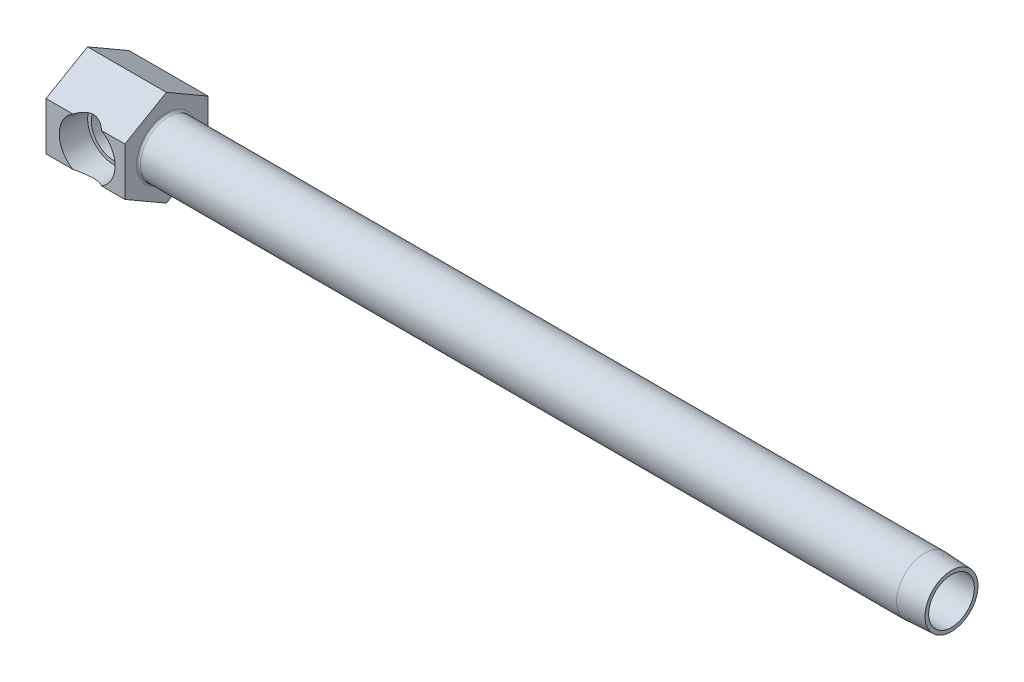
ISO-10303-21;
HEADER;
FILE_DESCRIPTION(('STEP AP214'),'2;1');
FILE_NAME('part.step','',(''),(''),'','','');
FILE_SCHEMA(('AUTOMOTIVE_DESIGN { 1 0 10303 214 1 1 1 1 }'));
ENDSEC;
DATA;
#1=APPLICATION_CONTEXT('core data for automotive mechanical design processes');
#2=APPLICATION_PROTOCOL_DEFINITION('international standard','automotive_design',2000,#1);
#3=PRODUCT_CONTEXT('',#1,'mechanical');
#4=PRODUCT('Part','Part','',(#3));
#5=PRODUCT_RELATED_PRODUCT_CATEGORY('part','',(#4));
#6=PRODUCT_DEFINITION_FORMATION('','',#4);
#7=PRODUCT_DEFINITION_CONTEXT('part definition',#1,'design');
#8=PRODUCT_DEFINITION('design','',#6,#7);
#9=PRODUCT_DEFINITION_SHAPE('','',#8);
#10=(LENGTH_UNIT() NAMED_UNIT(*) SI_UNIT(.MILLI.,.METRE.));
#11=(NAMED_UNIT(*) PLANE_ANGLE_UNIT() SI_UNIT($,.RADIAN.));
#12=(NAMED_UNIT(*) SI_UNIT($,.STERADIAN.) SOLID_ANGLE_UNIT());
#13=UNCERTAINTY_MEASURE_WITH_UNIT(LENGTH_MEASURE(1.E-05),#10,'distance_accuracy_value','');
#14=(GEOMETRIC_REPRESENTATION_CONTEXT(3) GLOBAL_UNCERTAINTY_ASSIGNED_CONTEXT((#13)) GLOBAL_UNIT_ASSIGNED_CONTEXT((#10,
#11,#12)) REPRESENTATION_CONTEXT('',''));
#15=CARTESIAN_POINT('',(0.,0.,0.));
#16=DIRECTION('',(0.,0.,1.));
#17=DIRECTION('',(1.,0.,0.));
#18=AXIS2_PLACEMENT_3D('',#15,#16,#17);
#19=CARTESIAN_POINT('',(63.5,0.,15.875));
#20=DIRECTION('',(-1.,0.,0.));
#21=DIRECTION('',(0.,0.,1.));
#22=AXIS2_PLACEMENT_3D('',#19,#20,#21);
#23=CYLINDRICAL_SURFACE('',#22,10.668);
#24=CARTESIAN_POINT('',(30.9499,0.,15.875));
#25=DIRECTION('',(1.,0.,0.));
#26=DIRECTION('',(0.,1.,0.));
#27=AXIS2_PLACEMENT_3D('',#24,#25,#26);
#28=CIRCLE('',#27,10.668);
#29=CARTESIAN_POINT('',(30.9499,10.668,15.875));
#30=VERTEX_POINT('',#29);
#31=EDGE_CURVE('E191',#30,#30,#28,.T.);
#32=ORIENTED_EDGE('',*,*,#31,.T.);
#33=EDGE_LOOP('',(#32));
#34=FACE_BOUND('',#33,.T.);
#35=CARTESIAN_POINT('',(319.8876,0.,15.875));
#36=DIRECTION('',(1.,0.,0.));
#37=DIRECTION('',(0.,0.,-1.));
#38=AXIS2_PLACEMENT_3D('',#35,#36,#37);
#39=CIRCLE('',#38,10.668);
#40=CARTESIAN_POINT('',(319.8876,0.,5.207));
#41=VERTEX_POINT('',#40);
#42=EDGE_CURVE('E256',#41,#41,#39,.T.);
#43=ORIENTED_EDGE('',*,*,#42,.F.);
#44=EDGE_LOOP('',(#43));
#45=FACE_BOUND('',#44,.T.);
#46=ADVANCED_FACE('F15',(#34,#45),#23,.T.);
#47=CARTESIAN_POINT('',(30.1625,18.3308710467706,15.875));
#48=DIRECTION('',(0.,-0.866025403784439,-0.5));
#49=DIRECTION('',(0.,0.5,-0.866025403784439));
#50=AXIS2_PLACEMENT_3D('',#47,#48,#49);
#51=PLANE('',#50);
#52=CARTESIAN_POINT('',(15.748,-1.05255916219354,49.4480859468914));
#53=DIRECTION('',(0.,-0.866025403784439,-0.5));
#54=DIRECTION('',(0.,-0.5,0.866025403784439));
#55=AXIS2_PLACEMENT_3D('',#52,#53,#54);
#56=ELLIPSE('',#55,23.191034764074,11.5476466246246);
#57=CARTESIAN_POINT('',(21.2070306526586,9.16543552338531,31.75));
#58=VERTEX_POINT('',#57);
#59=CARTESIAN_POINT('',(10.2889693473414,9.16543552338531,31.75));
#60=VERTEX_POINT('',#59);
#61=EDGE_CURVE('E135',#58,#60,#56,.F.);
#62=ORIENTED_EDGE('',*,*,#61,.F.);
#63=DIRECTION('',(-1.,0.,0.));
#64=VECTOR('',#63,1.);
#65=CARTESIAN_POINT('',(30.1625,9.16543552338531,31.75));
#66=LINE('',#65,#64);
#67=CARTESIAN_POINT('',(30.1625,9.16543552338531,31.75));
#68=VERTEX_POINT('',#67);
#69=EDGE_CURVE('E179',#68,#58,#66,.T.);
#70=ORIENTED_EDGE('',*,*,#69,.F.);
#71=DIRECTION('',(0.,-0.5,0.866025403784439));
#72=VECTOR('',#71,1.);
#73=CARTESIAN_POINT('',(30.1625,18.3308710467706,15.875));
#74=LINE('',#73,#72);
#75=CARTESIAN_POINT('',(30.1625,18.3308710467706,15.875));
#76=VERTEX_POINT('',#75);
#77=EDGE_CURVE('E163',#76,#68,#74,.T.);
#78=ORIENTED_EDGE('',*,*,#77,.F.);
#79=DIRECTION('',(-1.,0.,0.));
#80=VECTOR('',#79,1.);
#81=CARTESIAN_POINT('',(30.1625,18.3308710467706,15.875));
#82=LINE('',#81,#80);
#83=CARTESIAN_POINT('',(0.,18.3308710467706,15.875));
#84=VERTEX_POINT('',#83);
#85=EDGE_CURVE('E182',#76,#84,#82,.T.);
#86=ORIENTED_EDGE('',*,*,#85,.T.);
#87=DIRECTION('',(0.,-0.5,0.866025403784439));
#88=VECTOR('',#87,1.);
#89=CARTESIAN_POINT('',(0.,18.3308710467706,15.875));
#90=LINE('',#89,#88);
#91=CARTESIAN_POINT('',(0.,9.16543552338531,31.75));
#92=VERTEX_POINT('',#91);
#93=EDGE_CURVE('E144',#84,#92,#90,.T.);
#94=ORIENTED_EDGE('',*,*,#93,.T.);
#95=EDGE_CURVE('E178',#60,#92,#66,.T.);
#96=ORIENTED_EDGE('',*,*,#95,.F.);
#97=EDGE_LOOP('',(#62,#70,#78,#86,#94,#96));
#98=FACE_BOUND('',#97,.T.);
#99=ADVANCED_FACE('F210',(#98),#51,.F.);
#100=CARTESIAN_POINT('',(30.1625,9.16543552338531,31.75));
#101=DIRECTION('',(0.,0.,-1.));
#102=DIRECTION('',(-1.,0.,0.));
#103=AXIS2_PLACEMENT_3D('',#100,#101,#102);
#104=PLANE('',#103);
#105=CARTESIAN_POINT('',(15.748,0.,31.75));
#106=DIRECTION('',(0.,0.,-1.));
#107=DIRECTION('',(-1.,0.,0.));
#108=AXIS2_PLACEMENT_3D('',#105,#106,#107);
#109=CIRCLE('',#108,10.668);
#110=CARTESIAN_POINT('',(21.2070306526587,-9.1654355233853,31.75));
#111=VERTEX_POINT('',#110);
#112=EDGE_CURVE('E133',#58,#111,#109,.T.);
#113=ORIENTED_EDGE('',*,*,#112,.T.);
#114=DIRECTION('',(-1.,0.,0.));
#115=VECTOR('',#114,1.);
#116=CARTESIAN_POINT('',(30.1625,-9.1654355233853,31.75));
#117=LINE('',#116,#115);
#118=CARTESIAN_POINT('',(30.1625,-9.1654355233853,31.75));
#119=VERTEX_POINT('',#118);
#120=EDGE_CURVE('E175',#119,#111,#117,.T.);
#121=ORIENTED_EDGE('',*,*,#120,.F.);
#122=DIRECTION('',(0.,-1.,0.));
#123=VECTOR('',#122,1.);
#124=CARTESIAN_POINT('',(30.1625,9.16543552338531,31.75));
#125=LINE('',#124,#123);
#126=EDGE_CURVE('E165',#68,#119,#125,.T.);
#127=ORIENTED_EDGE('',*,*,#126,.F.);
#128=ORIENTED_EDGE('',*,*,#69,.T.);
#129=EDGE_LOOP('',(#113,#121,#127,#128));
#130=FACE_BOUND('',#129,.T.);
#131=ADVANCED_FACE('F206',(#130),#104,.F.);
#132=CARTESIAN_POINT('',(10.2889693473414,-9.1654355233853,31.75));
#133=VERTEX_POINT('',#132);
#134=EDGE_CURVE('E40',#133,#60,#109,.T.);
#135=ORIENTED_EDGE('',*,*,#134,.T.);
#136=ORIENTED_EDGE('',*,*,#95,.T.);
#137=DIRECTION('',(0.,-1.,0.));
#138=VECTOR('',#137,1.);
#139=CARTESIAN_POINT('',(0.,9.16543552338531,31.75));
#140=LINE('',#139,#138);
#141=CARTESIAN_POINT('',(0.,-9.1654355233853,31.75));
#142=VERTEX_POINT('',#141);
#143=EDGE_CURVE('E148',#92,#142,#140,.T.);
#144=ORIENTED_EDGE('',*,*,#143,.T.);
#145=EDGE_CURVE('E174',#133,#142,#117,.T.);
#146=ORIENTED_EDGE('',*,*,#145,.F.);
#147=EDGE_LOOP('',(#135,#136,#144,#146));
#148=FACE_BOUND('',#147,.T.);
#149=ADVANCED_FACE('F213',(#148),#104,.F.);
#150=CARTESIAN_POINT('',(30.1625,-9.1654355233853,31.75));
#151=DIRECTION('',(0.,0.866025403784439,-0.5));
#152=DIRECTION('',(0.,0.5,0.866025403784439));
#153=AXIS2_PLACEMENT_3D('',#150,#151,#152);
#154=PLANE('',#153);
#155=CARTESIAN_POINT('',(15.748,1.05255916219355,49.4480859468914));
#156=DIRECTION('',(0.,0.866025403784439,-0.5));
#157=DIRECTION('',(0.,0.5,0.866025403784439));
#158=AXIS2_PLACEMENT_3D('',#155,#156,#157);
#159=ELLIPSE('',#158,23.191034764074,11.5476466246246);
#160=EDGE_CURVE('E26',#133,#111,#159,.F.);
#161=ORIENTED_EDGE('',*,*,#160,.F.);
#162=ORIENTED_EDGE('',*,*,#145,.T.);
#163=DIRECTION('',(0.,-0.5,-0.866025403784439));
#164=VECTOR('',#163,1.);
#165=CARTESIAN_POINT('',(0.,-9.1654355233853,31.75));
#166=LINE('',#165,#164);
#167=CARTESIAN_POINT('',(0.,-18.3308710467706,15.875));
#168=VERTEX_POINT('',#167);
#169=EDGE_CURVE('E152',#142,#168,#166,.T.);
#170=ORIENTED_EDGE('',*,*,#169,.T.);
#171=DIRECTION('',(-1.,0.,0.));
#172=VECTOR('',#171,1.);
#173=CARTESIAN_POINT('',(30.1625,-18.3308710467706,15.875));
#174=LINE('',#173,#172);
#175=CARTESIAN_POINT('',(30.1625,-18.3308710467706,15.875));
#176=VERTEX_POINT('',#175);
#177=EDGE_CURVE('E169',#176,#168,#174,.T.);
#178=ORIENTED_EDGE('',*,*,#177,.F.);
#179=DIRECTION('',(0.,-0.5,-0.866025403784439));
#180=VECTOR('',#179,1.);
#181=CARTESIAN_POINT('',(30.1625,-9.1654355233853,31.75));
#182=LINE('',#181,#180);
#183=EDGE_CURVE('E167',#119,#176,#182,.T.);
#184=ORIENTED_EDGE('',*,*,#183,.F.);
#185=ORIENTED_EDGE('',*,*,#120,.T.);
#186=EDGE_LOOP('',(#161,#162,#170,#178,#184,#185));
#187=FACE_BOUND('',#186,.T.);
#188=ADVANCED_FACE('F202',(#187),#154,.F.);
#189=CARTESIAN_POINT('',(30.1625,-18.3308710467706,15.875));
#190=DIRECTION('',(0.,0.866025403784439,0.5));
#191=DIRECTION('',(0.,-0.5,0.866025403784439));
#192=AXIS2_PLACEMENT_3D('',#189,#190,#191);
#193=PLANE('',#192);
#194=DIRECTION('',(0.,0.5,-0.866025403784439));
#195=VECTOR('',#194,1.);
#196=CARTESIAN_POINT('',(0.,-18.3308710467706,15.875));
#197=LINE('',#196,#195);
#198=CARTESIAN_POINT('',(0.,-9.16543552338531,0.));
#199=VERTEX_POINT('',#198);
#200=EDGE_CURVE('E137',#168,#199,#197,.T.);
#201=ORIENTED_EDGE('',*,*,#200,.T.);
#202=DIRECTION('',(-1.,0.,0.));
#203=VECTOR('',#202,1.);
#204=CARTESIAN_POINT('',(30.1625,-9.16543552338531,0.));
#205=LINE('',#204,#203);
#206=CARTESIAN_POINT('',(30.1625,-9.16543552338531,0.));
#207=VERTEX_POINT('',#206);
#208=EDGE_CURVE('E188',#207,#199,#205,.T.);
#209=ORIENTED_EDGE('',*,*,#208,.F.);
#210=DIRECTION('',(0.,0.5,-0.866025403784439));
#211=VECTOR('',#210,1.);
#212=CARTESIAN_POINT('',(30.1625,-18.3308710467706,15.875));
#213=LINE('',#212,#211);
#214=EDGE_CURVE('E155',#176,#207,#213,.T.);
#215=ORIENTED_EDGE('',*,*,#214,.F.);
#216=ORIENTED_EDGE('',*,*,#177,.T.);
#217=EDGE_LOOP('',(#201,#209,#215,#216));
#218=FACE_BOUND('',#217,.T.);
#219=ADVANCED_FACE('F220',(#218),#193,.F.);
#220=CARTESIAN_POINT('',(30.1625,-9.16543552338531,0.));
#221=DIRECTION('',(0.,0.,1.));
#222=DIRECTION('',(0.,-1.,0.));
#223=AXIS2_PLACEMENT_3D('',#220,#221,#222);
#224=PLANE('',#223);
#225=DIRECTION('',(0.,1.,0.));
#226=VECTOR('',#225,1.);
#227=CARTESIAN_POINT('',(0.,-9.16543552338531,0.));
#228=LINE('',#227,#226);
#229=CARTESIAN_POINT('',(0.,9.16543552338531,0.));
#230=VERTEX_POINT('',#229);
#231=EDGE_CURVE('E138',#199,#230,#228,.T.);
#232=ORIENTED_EDGE('',*,*,#231,.T.);
#233=DIRECTION('',(-1.,0.,0.));
#234=VECTOR('',#233,1.);
#235=CARTESIAN_POINT('',(30.1625,9.16543552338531,0.));
#236=LINE('',#235,#234);
#237=CARTESIAN_POINT('',(30.1625,9.16543552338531,0.));
#238=VERTEX_POINT('',#237);
#239=EDGE_CURVE('E185',#238,#230,#236,.T.);
#240=ORIENTED_EDGE('',*,*,#239,.F.);
#241=DIRECTION('',(0.,1.,0.));
#242=VECTOR('',#241,1.);
#243=CARTESIAN_POINT('',(30.1625,-9.16543552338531,0.));
#244=LINE('',#243,#242);
#245=EDGE_CURVE('E159',#207,#238,#244,.T.);
#246=ORIENTED_EDGE('',*,*,#245,.F.);
#247=ORIENTED_EDGE('',*,*,#208,.T.);
#248=EDGE_LOOP('',(#232,#240,#246,#247));
#249=FACE_BOUND('',#248,.T.);
#250=ADVANCED_FACE('F227',(#249),#224,.F.);
#251=CARTESIAN_POINT('',(30.1625,9.16543552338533,0.));
#252=DIRECTION('',(0.,-0.86602540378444,0.5));
#253=DIRECTION('',(0.,-0.5,-0.86602540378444));
#254=AXIS2_PLACEMENT_3D('',#251,#252,#253);
#255=PLANE('',#254);
#256=DIRECTION('',(0.,0.5,0.86602540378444));
#257=VECTOR('',#256,1.);
#258=CARTESIAN_POINT('',(0.,9.16543552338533,0.));
#259=LINE('',#258,#257);
#260=EDGE_CURVE('E141',#230,#84,#259,.T.);
#261=ORIENTED_EDGE('',*,*,#260,.T.);
#262=ORIENTED_EDGE('',*,*,#85,.F.);
#263=DIRECTION('',(0.,0.5,0.86602540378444));
#264=VECTOR('',#263,1.);
#265=CARTESIAN_POINT('',(30.1625,9.16543552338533,0.));
#266=LINE('',#265,#264);
#267=EDGE_CURVE('E161',#238,#76,#266,.T.);
#268=ORIENTED_EDGE('',*,*,#267,.F.);
#269=ORIENTED_EDGE('',*,*,#239,.T.);
#270=EDGE_LOOP('',(#261,#262,#268,#269));
#271=FACE_BOUND('',#270,.T.);
#272=ADVANCED_FACE('F233',(#271),#255,.F.);
#273=CARTESIAN_POINT('',(30.1625,-9.16543552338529,0.));
#274=DIRECTION('',(1.,0.,0.));
#275=DIRECTION('',(0.,1.,0.));
#276=AXIS2_PLACEMENT_3D('',#273,#274,#275);
#277=PLANE('',#276);
#278=CARTESIAN_POINT('',(30.1625,0.,15.875));
#279=DIRECTION('',(1.,0.,0.));
#280=DIRECTION('',(0.,1.,0.));
#281=AXIS2_PLACEMENT_3D('',#278,#279,#280);
#282=CIRCLE('',#281,11.4554);
#283=CARTESIAN_POINT('',(30.1625,11.4554,15.875));
#284=VERTEX_POINT('',#283);
#285=EDGE_CURVE('E194',#284,#284,#282,.F.);
#286=ORIENTED_EDGE('',*,*,#285,.T.);
#287=EDGE_LOOP('',(#286));
#288=FACE_BOUND('',#287,.T.);
#289=ORIENTED_EDGE('',*,*,#214,.T.);
#290=ORIENTED_EDGE('',*,*,#245,.T.);
#291=ORIENTED_EDGE('',*,*,#267,.T.);
#292=ORIENTED_EDGE('',*,*,#77,.T.);
#293=ORIENTED_EDGE('',*,*,#126,.T.);
#294=ORIENTED_EDGE('',*,*,#183,.T.);
#295=EDGE_LOOP('',(#289,#290,#291,#292,#293,#294));
#296=FACE_BOUND('',#295,.T.);
#297=ADVANCED_FACE('F230',(#288,#296),#277,.T.);
#298=CARTESIAN_POINT('',(0.,-9.16543552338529,0.));
#299=DIRECTION('',(1.,0.,0.));
#300=DIRECTION('',(0.,1.,0.));
#301=AXIS2_PLACEMENT_3D('',#298,#299,#300);
#302=PLANE('',#301);
#303=ORIENTED_EDGE('',*,*,#200,.F.);
#304=ORIENTED_EDGE('',*,*,#169,.F.);
#305=ORIENTED_EDGE('',*,*,#143,.F.);
#306=ORIENTED_EDGE('',*,*,#93,.F.);
#307=ORIENTED_EDGE('',*,*,#260,.F.);
#308=ORIENTED_EDGE('',*,*,#231,.F.);
#309=EDGE_LOOP('',(#303,#304,#305,#306,#307,#308));
#310=FACE_BOUND('',#309,.T.);
#311=ADVANCED_FACE('F222',(#310),#302,.F.);
#312=CARTESIAN_POINT('',(30.9499,0.,15.875));
#313=DIRECTION('',(1.,0.,0.));
#314=DIRECTION('',(0.,1.,0.));
#315=AXIS2_PLACEMENT_3D('',#312,#313,#314);
#316=TOROIDAL_SURFACE('',#315,11.4554,0.7874);
#317=ORIENTED_EDGE('',*,*,#285,.F.);
#318=EDGE_LOOP('',(#317));
#319=FACE_BOUND('',#318,.T.);
#320=ORIENTED_EDGE('',*,*,#31,.F.);
#321=EDGE_LOOP('',(#320));
#322=FACE_BOUND('',#321,.T.);
#323=ADVANCED_FACE('F331',(#319,#322),#316,.F.);
#324=CARTESIAN_POINT('',(15.748,0.,31.75));
#325=DIRECTION('',(0.,0.,1.));
#326=DIRECTION('',(1.,0.,0.));
#327=AXIS2_PLACEMENT_3D('',#324,#325,#326);
#328=CONICAL_SURFACE('',#327,10.668,0.0523598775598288);
#329=CARTESIAN_POINT('',(23.3158678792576,-6.73011387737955,21.4374));
#330=CARTESIAN_POINT('',(23.4600282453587,-6.58213571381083,21.6163914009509));
#331=CARTESIAN_POINT('',(23.6023884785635,-6.42627781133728,21.7904706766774));
#332=CARTESIAN_POINT('',(23.8817354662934,-6.09837401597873,22.1280133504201));
#333=CARTESIAN_POINT('',(24.0187135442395,-5.92630339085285,22.2914598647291));
#334=CARTESIAN_POINT('',(24.2862441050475,-5.56440643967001,22.6077795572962));
#335=CARTESIAN_POINT('',(24.4167288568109,-5.37443622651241,22.7605461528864));
#336=CARTESIAN_POINT('',(24.6677167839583,-4.97815123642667,23.0522714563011));
#337=CARTESIAN_POINT('',(24.7882261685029,-4.77184678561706,23.1912387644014));
#338=CARTESIAN_POINT('',(24.9921660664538,-4.38969848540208,23.4250980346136));
#339=CARTESIAN_POINT('',(25.0779672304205,-4.21696245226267,23.5230096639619));
#340=CARTESIAN_POINT('',(25.2408840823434,-3.86199712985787,23.7082473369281));
#341=CARTESIAN_POINT('',(25.3180018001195,-3.67977007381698,23.7955758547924));
#342=CARTESIAN_POINT('',(25.4621670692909,-3.30686520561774,23.9583559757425));
#343=CARTESIAN_POINT('',(25.529240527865,-3.11621083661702,24.0338381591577));
#344=CARTESIAN_POINT('',(25.6523303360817,-2.72696762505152,24.1720474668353));
#345=CARTESIAN_POINT('',(25.7083523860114,-2.52838293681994,24.2347811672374));
#346=CARTESIAN_POINT('',(25.808749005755,-2.12236093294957,24.3470188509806));
#347=CARTESIAN_POINT('',(25.8530023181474,-1.91485526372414,24.3963851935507));
#348=CARTESIAN_POINT('',(25.9281094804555,-1.49442789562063,24.4800766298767));
#349=CARTESIAN_POINT('',(25.9589631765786,-1.2815061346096,24.5144015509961));
#350=CARTESIAN_POINT('',(26.0065047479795,-0.852126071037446,24.5672608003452));
#351=CARTESIAN_POINT('',(26.023192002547,-0.635667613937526,24.5857944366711));
#352=CARTESIAN_POINT('',(26.0419565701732,-0.201352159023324,24.6066338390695));
#353=CARTESIAN_POINT('',(26.0440358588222,0.0165046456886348,24.6089417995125));
#354=CARTESIAN_POINT('',(26.0342583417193,0.421689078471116,24.5980844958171));
#355=CARTESIAN_POINT('',(26.0242658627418,0.609123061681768,24.5869892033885));
#356=CARTESIAN_POINT('',(25.9935596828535,0.982016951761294,24.552869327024));
#357=CARTESIAN_POINT('',(25.9728460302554,1.16747686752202,24.5298447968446));
#358=CARTESIAN_POINT('',(25.9211099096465,1.53498981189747,24.4722733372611));
#359=CARTESIAN_POINT('',(25.8900948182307,1.71704518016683,24.437734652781));
#360=CARTESIAN_POINT('',(25.8183100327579,2.07675633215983,24.3576745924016));
#361=CARTESIAN_POINT('',(25.7775399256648,2.25441192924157,24.3121527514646));
#362=CARTESIAN_POINT('',(25.6868155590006,2.6047674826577,24.2106610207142));
#363=CARTESIAN_POINT('',(25.6368406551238,2.77745527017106,24.1546676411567));
#364=CARTESIAN_POINT('',(25.5285266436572,3.11671661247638,24.0330221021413));
#365=CARTESIAN_POINT('',(25.4701845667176,3.28328797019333,23.9673665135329));
#366=CARTESIAN_POINT('',(25.2834921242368,3.77365322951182,23.7566792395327));
#367=CARTESIAN_POINT('',(25.1436492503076,4.08744436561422,23.5981203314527));
#368=CARTESIAN_POINT('',(24.8735653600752,4.61896069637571,23.289353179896));
#369=CARTESIAN_POINT('',(24.7480029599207,4.84261456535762,23.1450088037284));
#370=CARTESIAN_POINT('',(24.4850001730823,5.27158893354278,22.8402219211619));
#371=CARTESIAN_POINT('',(24.34754826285,5.47689124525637,22.6797637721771));
#372=CARTESIAN_POINT('',(24.0644488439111,5.86754844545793,22.3458754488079));
#373=CARTESIAN_POINT('',(23.918859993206,6.05302358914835,22.1725357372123));
#374=CARTESIAN_POINT('',(23.6957580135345,6.31733501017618,21.90341371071));
#375=CARTESIAN_POINT('',(23.6206767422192,6.40304815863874,21.8122772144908));
#376=CARTESIAN_POINT('',(23.4691939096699,6.56995442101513,21.6270388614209));
#377=CARTESIAN_POINT('',(23.3927925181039,6.65114811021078,21.5329373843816));
#378=CARTESIAN_POINT('',(23.3158678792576,6.73011387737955,21.4374));
#379=B_SPLINE_CURVE_WITH_KNOTS('',3,(#329,#330,#331,#332,#333,#334,#335,#336,#337,#338,#339,
#340,#341,#342,#343,#344,#345,#346,#347,#348,#349,#350,#351,#352,#353,#354,#355,#356,#357,#358,
#359,#360,#361,#362,#363,#364,#365,#366,#367,#368,#369,#370,#371,#372,#373,#374,#375,#376,#377,
#378),.UNSPECIFIED.,.F.,.F.,(4,2,2,2,2,2,2,2,2,2,2,2,2,2,2,2,2,2,2,2,2,2,2,2,4),(0.,
0.820023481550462,1.64131879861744,2.46989520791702,3.29795193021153,3.94627694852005,
4.59445010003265,5.24092150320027,5.8870585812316,6.53961554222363,7.19217999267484,
7.84477303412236,8.49727781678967,9.06067705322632,9.6240737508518,10.187067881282,
10.7500858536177,11.3143822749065,11.8788794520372,13.0099648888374,13.8917191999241,
14.7743379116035,15.65125682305,16.0888974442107,16.5264822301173),.UNSPECIFIED.);
#380=CARTESIAN_POINT('',(23.3160289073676,-6.72994857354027,21.4376));
#381=VERTEX_POINT('',#380);
#382=CARTESIAN_POINT('',(23.3160289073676,6.72994857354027,21.4376));
#383=VERTEX_POINT('',#382);
#384=EDGE_CURVE('E119',#381,#383,#379,.T.);
#385=ORIENTED_EDGE('',*,*,#384,.F.);
#386=CARTESIAN_POINT('',(15.748,0.,21.4376));
#387=DIRECTION('',(0.,0.,-1.));
#388=DIRECTION('',(-1.,0.,0.));
#389=AXIS2_PLACEMENT_3D('',#386,#387,#388);
#390=CIRCLE('',#389,10.1275500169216);
#391=EDGE_CURVE('E121',#381,#383,#390,.T.);
#392=ORIENTED_EDGE('',*,*,#391,.T.);
#393=EDGE_LOOP('',(#385,#392));
#394=FACE_BOUND('',#393,.T.);
#395=ORIENTED_EDGE('',*,*,#61,.T.);
#396=ORIENTED_EDGE('',*,*,#134,.F.);
#397=ORIENTED_EDGE('',*,*,#160,.T.);
#398=ORIENTED_EDGE('',*,*,#112,.F.);
#399=EDGE_LOOP('',(#395,#396,#397,#398));
#400=FACE_BOUND('',#399,.T.);
#401=ADVANCED_FACE('F196',(#394,#400),#328,.F.);
#402=CARTESIAN_POINT('',(25.8755500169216,0.,21.4376));
#403=DIRECTION('',(0.,0.,1.));
#404=DIRECTION('',(1.,0.,0.));
#405=AXIS2_PLACEMENT_3D('',#402,#403,#404);
#406=PLANE('',#405);
#407=DIRECTION('',(1.,0.,0.));
#408=VECTOR('',#407,1.);
#409=CARTESIAN_POINT('',(86.8155901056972,-6.72994857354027,21.4376));
#410=LINE('',#409,#408);
#411=CARTESIAN_POINT('',(21.3205618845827,-6.72994857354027,21.4376));
#412=VERTEX_POINT('',#411);
#413=EDGE_CURVE('E123',#412,#381,#410,.T.);
#414=ORIENTED_EDGE('',*,*,#413,.F.);
#415=CARTESIAN_POINT('',(15.748,0.,21.4376));
#416=DIRECTION('',(0.,0.,-1.));
#417=DIRECTION('',(-1.,0.,0.));
#418=AXIS2_PLACEMENT_3D('',#415,#416,#417);
#419=CIRCLE('',#418,8.7376);
#420=CARTESIAN_POINT('',(21.3205618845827,6.72994857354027,21.4376));
#421=VERTEX_POINT('',#420);
#422=EDGE_CURVE('E114',#412,#421,#419,.T.);
#423=ORIENTED_EDGE('',*,*,#422,.T.);
#424=DIRECTION('',(1.,0.,0.));
#425=VECTOR('',#424,1.);
#426=CARTESIAN_POINT('',(86.8155901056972,6.72994857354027,21.4376));
#427=LINE('',#426,#425);
#428=EDGE_CURVE('E115',#383,#421,#427,.F.);
#429=ORIENTED_EDGE('',*,*,#428,.F.);
#430=ORIENTED_EDGE('',*,*,#391,.F.);
#431=EDGE_LOOP('',(#414,#423,#429,#430));
#432=FACE_BOUND('',#431,.T.);
#433=ADVANCED_FACE('F316',(#432),#406,.T.);
#434=CARTESIAN_POINT('',(15.748,0.,43.0975954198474));
#435=DIRECTION('',(0.,0.,-1.));
#436=DIRECTION('',(-1.,0.,0.));
#437=AXIS2_PLACEMENT_3D('',#434,#435,#436);
#438=CYLINDRICAL_SURFACE('',#437,8.7376);
#439=CARTESIAN_POINT('',(24.4856,0.,7.14375000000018));
#440=CARTESIAN_POINT('',(24.4855979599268,-0.194584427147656,7.14375204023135));
#441=CARTESIAN_POINT('',(24.4790855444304,-0.389211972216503,7.15026918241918));
#442=CARTESIAN_POINT('',(24.4531687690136,-0.776828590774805,7.17620489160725));
#443=CARTESIAN_POINT('',(24.4337566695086,-0.969816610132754,7.19563120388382));
#444=CARTESIAN_POINT('',(24.3824080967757,-1.35279132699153,7.24701779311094));
#445=CARTESIAN_POINT('',(24.3504484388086,-1.54277178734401,7.27900127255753));
#446=CARTESIAN_POINT('',(24.2746397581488,-1.91800162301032,7.3548673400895));
#447=CARTESIAN_POINT('',(24.230784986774,-2.10324866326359,7.39875568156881));
#448=CARTESIAN_POINT('',(24.1323992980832,-2.46629304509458,7.49721818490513));
#449=CARTESIAN_POINT('',(24.0779544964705,-2.64413729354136,7.55170615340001));
#450=CARTESIAN_POINT('',(23.9590478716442,-2.99304779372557,7.6707093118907));
#451=CARTESIAN_POINT('',(23.8945822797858,-3.16411146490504,7.73522827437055));
#452=CARTESIAN_POINT('',(23.7566100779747,-3.49864884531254,7.87331790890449));
#453=CARTESIAN_POINT('',(23.6831076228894,-3.66212599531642,7.94688442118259));
#454=CARTESIAN_POINT('',(23.5279457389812,-3.98115293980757,8.10218588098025));
#455=CARTESIAN_POINT('',(23.4462844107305,-4.13670087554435,8.18392273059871));
#456=CARTESIAN_POINT('',(23.2407563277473,-4.50158308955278,8.38964777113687));
#457=CARTESIAN_POINT('',(23.1132942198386,-4.7068770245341,8.51723745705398));
#458=CARTESIAN_POINT('',(22.84617651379,-5.10080513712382,8.7846388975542));
#459=CARTESIAN_POINT('',(22.7065197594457,-5.28943773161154,8.92445181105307));
#460=CARTESIAN_POINT('',(22.4166157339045,-5.65057111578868,9.21470277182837));
#461=CARTESIAN_POINT('',(22.2663444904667,-5.82303320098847,9.36516487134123));
#462=CARTESIAN_POINT('',(21.9571971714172,-6.15161912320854,9.67473646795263));
#463=CARTESIAN_POINT('',(21.7983210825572,-6.30774293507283,9.83384597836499));
#464=CARTESIAN_POINT('',(21.410466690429,-6.66146937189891,10.2223222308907));
#465=CARTESIAN_POINT('',(21.1781519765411,-6.85174414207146,10.4550504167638));
#466=CARTESIAN_POINT('',(20.7027527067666,-7.20301910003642,10.9314300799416));
#467=CARTESIAN_POINT('',(20.4596630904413,-7.36400534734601,11.1750866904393));
#468=CARTESIAN_POINT('',(19.9655914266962,-7.65767994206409,11.6705392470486));
#469=CARTESIAN_POINT('',(19.7146188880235,-7.79040098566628,11.922325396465));
#470=CARTESIAN_POINT('',(19.2066974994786,-8.0288054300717,12.432296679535));
#471=CARTESIAN_POINT('',(18.9497514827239,-8.13450137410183,12.6904787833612));
#472=CARTESIAN_POINT('',(18.535849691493,-8.28254836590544,13.1070621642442));
#473=CARTESIAN_POINT('',(18.3802144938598,-8.3332845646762,13.2638590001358));
#474=CARTESIAN_POINT('',(18.0678223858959,-8.42559206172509,13.5791092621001));
#475=CARTESIAN_POINT('',(17.9110652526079,-8.46716148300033,13.7375630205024));
#476=CARTESIAN_POINT('',(17.6309955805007,-8.53322740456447,14.0215802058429));
#477=CARTESIAN_POINT('',(17.5077848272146,-8.5594718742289,14.1468425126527));
#478=CARTESIAN_POINT('',(17.2618022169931,-8.60637337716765,14.3980579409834));
#479=CARTESIAN_POINT('',(17.1390302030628,-8.62704779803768,14.5240076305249));
#480=CARTESIAN_POINT('',(16.9357825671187,-8.65687758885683,14.7346643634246));
#481=CARTESIAN_POINT('',(16.8550481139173,-8.66756378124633,14.8189101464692));
#482=CARTESIAN_POINT('',(16.6937016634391,-8.68665280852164,14.9894220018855));
#483=CARTESIAN_POINT('',(16.6130990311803,-8.6950316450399,15.0756998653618));
#484=CARTESIAN_POINT('',(16.4936864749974,-8.70581636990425,15.2075729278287));
#485=CARTESIAN_POINT('',(16.453897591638,-8.70912835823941,15.2522143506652));
#486=CARTESIAN_POINT('',(16.3753514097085,-8.71513811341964,15.3428639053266));
#487=CARTESIAN_POINT('',(16.336600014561,-8.71783283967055,15.3888775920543));
#488=CARTESIAN_POINT('',(16.2623845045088,-8.72252382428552,15.4819945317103));
#489=CARTESIAN_POINT('',(16.2268715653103,-8.72453249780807,15.5290599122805));
#490=CARTESIAN_POINT('',(16.1615894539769,-8.72786360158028,15.6269900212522));
#491=CARTESIAN_POINT('',(16.1317624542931,-8.72919320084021,15.6778082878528));
#492=CARTESIAN_POINT('',(16.106026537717,-8.73026315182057,15.7432733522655));
#493=CARTESIAN_POINT('',(16.1020065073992,-8.73042652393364,15.7545502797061));
#494=CARTESIAN_POINT('',(16.0948910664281,-8.73071197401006,15.7773932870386));
#495=CARTESIAN_POINT('',(16.0917959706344,-8.73083403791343,15.788959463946));
#496=CARTESIAN_POINT('',(16.0842173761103,-8.7311305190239,15.8238300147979));
#497=CARTESIAN_POINT('',(16.0813461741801,-8.7312389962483,15.8475287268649));
#498=CARTESIAN_POINT('',(16.080808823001,-8.73125946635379,15.8951415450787));
#499=CARTESIAN_POINT('',(16.083177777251,-8.73117013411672,15.9190560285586));
#500=CARTESIAN_POINT('',(16.0925113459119,-8.73080677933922,15.9661053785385));
#501=CARTESIAN_POINT('',(16.099514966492,-8.73053118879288,15.9892318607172));
#502=CARTESIAN_POINT('',(16.1262284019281,-8.72942751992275,16.0598051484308));
#503=CARTESIAN_POINT('',(16.151337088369,-8.7283274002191,16.1050597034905));
#504=CARTESIAN_POINT('',(16.2067600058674,-8.72559491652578,16.1922079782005));
#505=CARTESIAN_POINT('',(16.2371111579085,-8.72395869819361,16.2340745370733));
#506=CARTESIAN_POINT('',(16.3394034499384,-8.71784635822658,16.3674166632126));
#507=CARTESIAN_POINT('',(16.4158450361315,-8.71237926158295,16.4553852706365));
#508=CARTESIAN_POINT('',(16.5713693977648,-8.69907947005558,16.6287851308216));
#509=CARTESIAN_POINT('',(16.6504566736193,-8.69124254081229,16.7142115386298));
#510=CARTESIAN_POINT('',(16.8096315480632,-8.67323190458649,16.8834717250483));
#511=CARTESIAN_POINT('',(16.8897156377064,-8.66306494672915,16.9673093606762));
#512=CARTESIAN_POINT('',(17.0502749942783,-8.64038918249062,17.1341543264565));
#513=CARTESIAN_POINT('',(17.1307499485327,-8.62788201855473,17.2171621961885));
#514=CARTESIAN_POINT('',(17.3707828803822,-8.58710464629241,17.463693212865));
#515=CARTESIAN_POINT('',(17.5305844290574,-8.5553951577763,17.626432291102));
#516=CARTESIAN_POINT('',(17.8496978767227,-8.48264950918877,17.9503078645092));
#517=CARTESIAN_POINT('',(18.0090097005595,-8.44161198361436,18.1114441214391));
#518=CARTESIAN_POINT('',(18.4856528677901,-8.30423407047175,18.592695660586));
#519=CARTESIAN_POINT('',(18.8014587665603,-8.1936672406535,18.9104166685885));
#520=CARTESIAN_POINT('',(19.4255974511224,-7.93318916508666,19.5375986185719));
#521=CARTESIAN_POINT('',(19.7339228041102,-7.78324040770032,19.8470513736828));
#522=CARTESIAN_POINT('',(20.3391141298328,-7.44229907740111,20.4540803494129));
#523=CARTESIAN_POINT('',(20.6359893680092,-7.25134054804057,20.7516661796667));
#524=CARTESIAN_POINT('',(21.1000219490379,-6.910044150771,21.2166598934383));
#525=CARTESIAN_POINT('',(21.2721889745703,-6.7733595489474,21.3891483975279));
#526=CARTESIAN_POINT('',(21.6095045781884,-6.48366113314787,21.7270430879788));
#527=CARTESIAN_POINT('',(21.7746536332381,-6.33064843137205,21.8924497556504));
#528=CARTESIAN_POINT('',(22.2570327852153,-5.84682072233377,22.3755293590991));
#529=CARTESIAN_POINT('',(22.5620480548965,-5.49060305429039,22.6809166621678));
#530=CARTESIAN_POINT('',(23.069916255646,-4.78392446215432,23.1893448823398));
#531=CARTESIAN_POINT('',(23.2811256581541,-4.44561570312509,23.4007639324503));
#532=CARTESIAN_POINT('',(23.5668242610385,-3.90553017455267,23.6867285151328));
#533=CARTESIAN_POINT('',(23.6568667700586,-3.72007663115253,23.7768515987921));
#534=CARTESIAN_POINT('',(23.8252338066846,-3.33876204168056,23.9453649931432));
#535=CARTESIAN_POINT('',(23.9035605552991,-3.14290297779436,24.0237575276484));
#536=CARTESIAN_POINT('',(24.0342740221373,-2.77741093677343,24.1545782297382));
#537=CARTESIAN_POINT('',(24.0887969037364,-2.60930304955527,24.2091448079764));
#538=CARTESIAN_POINT('',(24.1881404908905,-2.26745357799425,24.3085667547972));
#539=CARTESIAN_POINT('',(24.232963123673,-2.0937131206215,24.3534240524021));
#540=CARTESIAN_POINT('',(24.3121701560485,-1.74160557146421,24.4326916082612));
#541=CARTESIAN_POINT('',(24.3465592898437,-1.5632406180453,24.4671066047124));
#542=CARTESIAN_POINT('',(24.4043171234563,-1.20295803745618,24.5249075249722));
#543=CARTESIAN_POINT('',(24.427685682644,-1.02104036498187,24.548293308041));
#544=CARTESIAN_POINT('',(24.463023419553,-0.654283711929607,24.5836569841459));
#545=CARTESIAN_POINT('',(24.4749486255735,-0.46943621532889,24.5955908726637));
#546=CARTESIAN_POINT('',(24.4870048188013,-0.0989697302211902,24.6076558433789));
#547=CARTESIAN_POINT('',(24.4871357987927,0.086649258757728,24.6077869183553));
#548=CARTESIAN_POINT('',(24.4756009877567,0.457153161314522,24.59624371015));
#549=CARTESIAN_POINT('',(24.4639348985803,0.642038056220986,24.5845691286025));
#550=CARTESIAN_POINT('',(24.4290390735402,1.00960102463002,24.5496476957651));
#551=CARTESIAN_POINT('',(24.4058095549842,1.19227913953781,24.5264010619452));
#552=CARTESIAN_POINT('',(24.3499037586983,1.5435978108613,24.4704535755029));
#553=CARTESIAN_POINT('',(24.3178522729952,1.71243875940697,24.4383780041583));
#554=CARTESIAN_POINT('',(24.2443827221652,2.0460500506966,24.3648524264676));
#555=CARTESIAN_POINT('',(24.2029611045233,2.21081882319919,24.3233988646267));
#556=CARTESIAN_POINT('',(24.1113637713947,2.53539687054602,24.231729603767));
#557=CARTESIAN_POINT('',(24.0611880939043,2.69520616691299,24.1815139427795));
#558=CARTESIAN_POINT('',(23.9527394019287,3.0092382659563,24.0729769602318));
#559=CARTESIAN_POINT('',(23.8944647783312,3.16345995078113,24.0146540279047));
#560=CARTESIAN_POINT('',(23.7478576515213,3.52103226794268,23.8679223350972));
#561=CARTESIAN_POINT('',(23.6563189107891,3.72176242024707,23.776303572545));
#562=CARTESIAN_POINT('',(23.4611265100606,4.11105686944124,23.5809334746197));
#563=CARTESIAN_POINT('',(23.3574693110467,4.29961758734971,23.4771785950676));
#564=CARTESIAN_POINT('',(23.1395028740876,4.66439092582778,23.2589969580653));
#565=CARTESIAN_POINT('',(23.0251788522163,4.84058579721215,23.1445553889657));
#566=CARTESIAN_POINT('',(22.7874660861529,5.18020722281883,22.9065848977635));
#567=CARTESIAN_POINT('',(22.6640769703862,5.34363325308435,22.7830556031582));
#568=CARTESIAN_POINT('',(22.3624933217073,5.71583582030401,22.4811084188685));
#569=CARTESIAN_POINT('',(22.1808835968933,5.9190794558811,22.2992637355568));
#570=CARTESIAN_POINT('',(21.8058537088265,6.30238103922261,21.9236994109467));
#571=CARTESIAN_POINT('',(21.6124292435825,6.48243046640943,21.7299754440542));
#572=CARTESIAN_POINT('',(21.2157200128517,6.8203891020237,21.3325794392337));
#573=CARTESIAN_POINT('',(21.0124171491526,6.97825543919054,21.1288891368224));
#574=CARTESIAN_POINT('',(20.5982380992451,7.27223101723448,20.7138083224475));
#575=CARTESIAN_POINT('',(20.3873623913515,7.40834162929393,20.5024182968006));
#576=CARTESIAN_POINT('',(19.884649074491,7.70363293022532,19.9982794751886));
#577=CARTESIAN_POINT('',(19.59030513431,7.85421669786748,19.7029484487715));
#578=CARTESIAN_POINT('',(19.1430322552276,8.05270383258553,19.2536843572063));
#579=CARTESIAN_POINT('',(18.9929116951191,8.11432340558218,19.1028145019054));
#580=CARTESIAN_POINT('',(18.6911065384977,8.2285969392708,18.7992470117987));
#581=CARTESIAN_POINT('',(18.5394220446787,8.28125148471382,18.6465494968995));
#582=CARTESIAN_POINT('',(18.2352261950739,8.37763466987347,18.3399014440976));
#583=CARTESIAN_POINT('',(18.0827174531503,8.42138304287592,18.1859544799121));
#584=CARTESIAN_POINT('',(17.7769311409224,8.5002358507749,17.8765529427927));
#585=CARTESIAN_POINT('',(17.6236534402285,8.53533876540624,17.721098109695));
#586=CARTESIAN_POINT('',(17.3172180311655,8.59695458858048,17.4087584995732));
#587=CARTESIAN_POINT('',(17.164060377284,8.62347694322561,17.2518754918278));
#588=CARTESIAN_POINT('',(16.8589569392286,8.66804695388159,16.935768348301));
#589=CARTESIAN_POINT('',(16.7070105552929,8.68609909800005,16.7765454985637));
#590=CARTESIAN_POINT('',(16.46350407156,8.70877341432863,16.5098735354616));
#591=CARTESIAN_POINT('',(16.3699008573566,8.71589085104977,16.4044258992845));
#592=CARTESIAN_POINT('',(16.2323264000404,8.72430499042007,16.2291085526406));
#593=CARTESIAN_POINT('',(16.1841543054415,8.72679002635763,16.163138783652));
#594=CARTESIAN_POINT('',(16.133496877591,8.729101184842,16.0698810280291));
#595=CARTESIAN_POINT('',(16.1225051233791,8.72957575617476,16.0475182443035));
#596=CARTESIAN_POINT('',(16.1036531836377,8.73036364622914,16.0015173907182));
#597=CARTESIAN_POINT('',(16.0957832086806,8.73067746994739,15.9778835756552));
#598=CARTESIAN_POINT('',(16.0858252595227,8.73106804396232,15.9345234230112));
#599=CARTESIAN_POINT('',(16.0828762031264,8.73118048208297,15.9150042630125));
#600=CARTESIAN_POINT('',(16.0804848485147,8.73127193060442,15.8757632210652));
#601=CARTESIAN_POINT('',(16.0810378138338,8.73125112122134,15.8560416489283));
#602=CARTESIAN_POINT('',(16.085496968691,8.73107971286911,15.8170943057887));
#603=CARTESIAN_POINT('',(16.0893884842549,8.7309296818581,15.7978667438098));
#604=CARTESIAN_POINT('',(16.0998433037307,8.73051484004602,15.7601398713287));
#605=CARTESIAN_POINT('',(16.1064126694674,8.73024976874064,15.7416423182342));
#606=CARTESIAN_POINT('',(16.1364699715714,8.72898749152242,15.6687660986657));
#607=CARTESIAN_POINT('',(16.167275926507,8.72759479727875,15.6175941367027));
#608=CARTESIAN_POINT('',(16.2343481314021,8.72412321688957,15.51885530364));
#609=CARTESIAN_POINT('',(16.2706691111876,8.72203717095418,15.4713327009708));
#610=CARTESIAN_POINT('',(16.3943809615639,8.71408023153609,15.3171540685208));
#611=CARTESIAN_POINT('',(16.4865189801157,8.70682435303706,15.2143256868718));
#612=CARTESIAN_POINT('',(16.6731786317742,8.68900060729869,15.0111482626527));
#613=CARTESIAN_POINT('',(16.7677038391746,8.67842746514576,14.9108034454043));
#614=CARTESIAN_POINT('',(16.9573900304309,8.65402061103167,14.7119565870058));
#615=CARTESIAN_POINT('',(17.0525458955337,8.64020255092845,14.6134480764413));
#616=CARTESIAN_POINT('',(17.2430914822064,8.60927992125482,14.4173129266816));
#617=CARTESIAN_POINT('',(17.3384810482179,8.59217714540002,14.3196858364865));
#618=CARTESIAN_POINT('',(17.7459864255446,8.51203730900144,13.9038911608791));
#619=CARTESIAN_POINT('',(18.0580987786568,8.43292269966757,13.5886112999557));
#620=CARTESIAN_POINT('',(18.6776048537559,8.23825366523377,12.9641986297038));
#621=CARTESIAN_POINT('',(18.9849941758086,8.1226671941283,12.655071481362));
#622=CARTESIAN_POINT('',(19.5923220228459,7.85348929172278,12.0450114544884));
#623=CARTESIAN_POINT('',(19.8922482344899,7.6998391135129,11.744092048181));
#624=CARTESIAN_POINT('',(20.4804833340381,7.35294307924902,11.1542044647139));
#625=CARTESIAN_POINT('',(20.7688011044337,7.15972821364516,10.865227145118));
#626=CARTESIAN_POINT('',(21.2206780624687,6.81483228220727,10.4124550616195));
#627=CARTESIAN_POINT('',(21.3891940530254,6.67617271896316,10.2436383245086));
#628=CARTESIAN_POINT('',(21.7190895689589,6.38282740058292,9.91319894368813));
#629=CARTESIAN_POINT('',(21.8804695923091,6.22814276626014,9.75157579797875));
#630=CARTESIAN_POINT('',(22.3513310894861,5.73984762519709,9.28005235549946));
#631=CARTESIAN_POINT('',(22.6484248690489,5.38133142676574,8.9826055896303));
#632=CARTESIAN_POINT('',(23.141492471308,4.67228730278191,8.48900613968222));
#633=CARTESIAN_POINT('',(23.3459092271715,4.33363653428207,8.2843900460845));
#634=CARTESIAN_POINT('',(23.62145792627,3.79409663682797,8.00858862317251));
#635=CARTESIAN_POINT('',(23.7081391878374,3.60895802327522,7.92183082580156));
#636=CARTESIAN_POINT('',(23.8698120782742,3.2286920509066,7.76001907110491));
#637=CARTESIAN_POINT('',(23.9448062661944,3.03356689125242,7.68496255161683));
#638=CARTESIAN_POINT('',(24.0697191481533,2.66926471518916,7.55994813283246));
#639=CARTESIAN_POINT('',(24.1217294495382,2.50151910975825,7.50789648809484));
#640=CARTESIAN_POINT('',(24.2160793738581,2.16067893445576,7.41347268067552));
#641=CARTESIAN_POINT('',(24.2584209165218,1.98758543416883,7.37109859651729));
#642=CARTESIAN_POINT('',(24.3326749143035,1.63737162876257,7.29678816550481));
#643=CARTESIAN_POINT('',(24.3646094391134,1.46026070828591,7.26482973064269));
#644=CARTESIAN_POINT('',(24.4175977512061,1.10287331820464,7.21180203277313));
#645=CARTESIAN_POINT('',(24.4386569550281,0.922598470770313,7.1907273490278));
#646=CARTESIAN_POINT('',(24.4645620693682,0.61842168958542,7.16480325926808));
#647=CARTESIAN_POINT('',(24.472443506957,0.495022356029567,7.15691607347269));
#648=CARTESIAN_POINT('',(24.48296362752,0.247754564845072,7.14638828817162));
#649=CARTESIAN_POINT('',(24.4856012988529,0.123886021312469,7.14374870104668));
#650=CARTESIAN_POINT('',(24.4856,0.,7.14375000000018));
#651=B_SPLINE_CURVE_WITH_KNOTS('',3,(#439,#440,#441,#442,#443,#444,#445,#446,#447,#448,#449,
#450,#451,#452,#453,#454,#455,#456,#457,#458,#459,#460,#461,#462,#463,#464,#465,#466,#467,#468,
#469,#470,#471,#472,#473,#474,#475,#476,#477,#478,#479,#480,#481,#482,#483,#484,#485,#486,#487,
#488,#489,#490,#491,#492,#493,#494,#495,#496,#497,#498,#499,#500,#501,#502,#503,#504,#505,#506,
#507,#508,#509,#510,#511,#512,#513,#514,#515,#516,#517,#518,#519,#520,#521,#522,#523,#524,#525,
#526,#527,#528,#529,#530,#531,#532,#533,#534,#535,#536,#537,#538,#539,#540,#541,#542,#543,#544,
#545,#546,#547,#548,#549,#550,#551,#552,#553,#554,#555,#556,#557,#558,#559,#560,#561,#562,#563,
#564,#565,#566,#567,#568,#569,#570,#571,#572,#573,#574,#575,#576,#577,#578,#579,#580,#581,#582,
#583,#584,#585,#586,#587,#588,#589,#590,#591,#592,#593,#594,#595,#596,#597,#598,#599,#600,#601,
#602,#603,#604,#605,#606,#607,#608,#609,#610,#611,#612,#613,#614,#615,#616,#617,#618,#619,#620,
#621,#622,#623,#624,#625,#626,#627,#628,#629,#630,#631,#632,#633,#634,#635,#636,#637,#638,#639,
#640,#641,#642,#643,#644,#645,#646,#647,#648,#649,#650),.UNSPECIFIED.,.T.,.F.,(4,2,2,2,2,2,2,2,
2,2,2,2,2,2,2,2,2,2,2,2,2,2,2,2,2,2,2,2,2,2,2,2,2,2,2,2,2,2,2,2,2,2,2,2,2,2,2,2,2,2,2,2,2,2,2,2,
2,2,2,2,2,2,2,2,2,2,2,2,2,2,2,2,2,2,2,2,2,2,2,2,2,2,2,2,2,2,2,2,2,2,2,2,2,2,2,2,2,2,2,2,2,2,2,2,
2,4),(0.,0.583612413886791,1.16757530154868,1.75262232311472,2.3379525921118,2.91870833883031,
3.49968302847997,4.08039159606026,4.66123567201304,5.47979311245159,6.29842824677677,
7.11897529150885,7.93952359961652,9.07759978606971,10.2162162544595,11.3535083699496,
12.4902716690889,13.1701291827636,13.85012577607,14.3830023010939,14.9141955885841,
15.2656970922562,15.62072714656,15.8004033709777,15.9809464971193,16.1580238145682,
16.3331909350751,16.3690696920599,16.4049606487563,16.4760278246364,16.5475725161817,
16.61972713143,16.7737867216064,16.9289791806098,17.2784485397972,17.6285460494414,
17.9776420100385,18.3264938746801,19.0170858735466,19.7077790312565,21.0901665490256,
22.4738756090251,23.8564404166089,24.6940964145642,25.5316953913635,27.2028655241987,
28.5515700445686,29.225841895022,29.8999857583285,30.4543223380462,31.0085486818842,
31.5625231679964,32.1165047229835,32.67260655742,33.2287087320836,33.7848249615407,
34.3409307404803,34.8648402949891,35.3889488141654,35.9130550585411,36.4372655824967,
37.1528654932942,37.8686749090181,38.5854915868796,39.3023376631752,40.2838426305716,
41.265707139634,42.2494438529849,43.2331185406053,44.5610507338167,45.2256261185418,
45.8901581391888,46.5532013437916,47.2163610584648,47.8787882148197,48.5408639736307,
48.964542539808,49.208361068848,49.2829836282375,49.3573702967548,49.4163167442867,
49.4751834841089,49.5337928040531,49.5925355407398,49.7702540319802,49.949867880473,
50.3640564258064,50.7789069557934,51.1917961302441,51.6044604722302,52.9547097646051,
54.3061487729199,55.6596867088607,57.0121684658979,57.8392729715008,58.6663196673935,
60.3161744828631,61.6467920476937,62.3123085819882,62.9776791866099,63.5266629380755,
64.0755375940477,64.6232405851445,65.1706705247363,65.5421672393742,65.9137356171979),.UNSPECIFIED.);
#652=CARTESIAN_POINT('',(23.410585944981,-4.1988606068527,8.21965571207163));
#653=VERTEX_POINT('',#652);
#654=EDGE_CURVE('E104',#653,#412,#651,.T.);
#655=ORIENTED_EDGE('',*,*,#654,.F.);
#656=CARTESIAN_POINT('',(15.748,0.,8.21965571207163));
#657=DIRECTION('',(0.,0.,-1.));
#658=DIRECTION('',(-1.,0.,0.));
#659=AXIS2_PLACEMENT_3D('',#656,#657,#658);
#660=CIRCLE('',#659,8.7376);
#661=CARTESIAN_POINT('',(23.410585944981,4.19886060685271,8.21965571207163));
#662=VERTEX_POINT('',#661);
#663=EDGE_CURVE('E112',#653,#662,#660,.T.);
#664=ORIENTED_EDGE('',*,*,#663,.T.);
#665=EDGE_CURVE('E32',#421,#662,#651,.T.);
#666=ORIENTED_EDGE('',*,*,#665,.F.);
#667=ORIENTED_EDGE('',*,*,#422,.F.);
#668=EDGE_LOOP('',(#655,#664,#666,#667));
#669=FACE_BOUND('',#668,.T.);
#670=ADVANCED_FACE('F111',(#669),#438,.F.);
#671=CARTESIAN_POINT('',(15.748,0.,8.21965571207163));
#672=DIRECTION('',(0.,0.,1.));
#673=DIRECTION('',(1.,0.,0.));
#674=AXIS2_PLACEMENT_3D('',#671,#672,#673);
#675=CONICAL_SURFACE('',#674,8.7376,1.0471975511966);
#676=CARTESIAN_POINT('',(23.4107811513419,4.19922522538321,8.21985571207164));
#677=CARTESIAN_POINT('',(23.367919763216,4.11919395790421,8.17595278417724));
#678=CARTESIAN_POINT('',(23.3270293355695,4.03767589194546,8.13287159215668));
#679=CARTESIAN_POINT('',(23.2492204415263,3.8718198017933,8.04860939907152));
#680=CARTESIAN_POINT('',(23.2123017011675,3.78748197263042,8.00742826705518));
#681=CARTESIAN_POINT('',(23.1076914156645,3.53082485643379,7.8872854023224));
#682=CARTESIAN_POINT('',(23.0459592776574,3.35451271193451,7.81153115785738));
#683=CARTESIAN_POINT('',(22.9381824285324,2.9949771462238,7.67123528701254));
#684=CARTESIAN_POINT('',(22.8919973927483,2.81183308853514,7.60659608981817));
#685=CARTESIAN_POINT('',(22.8127166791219,2.43901153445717,7.48904901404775));
#686=CARTESIAN_POINT('',(22.7796265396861,2.24933131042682,7.43614610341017));
#687=CARTESIAN_POINT('',(22.7225896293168,1.85315874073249,7.34009061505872));
#688=CARTESIAN_POINT('',(22.6993570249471,1.64636373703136,7.29777066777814));
#689=CARTESIAN_POINT('',(22.6626845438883,1.22942523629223,7.2281547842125));
#690=CARTESIAN_POINT('',(22.6492454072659,1.01928148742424,7.20085998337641));
#691=CARTESIAN_POINT('',(22.6302721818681,0.596327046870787,7.16153764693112));
#692=CARTESIAN_POINT('',(22.6247719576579,0.383508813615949,7.14957553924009));
#693=CARTESIAN_POINT('',(22.6209210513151,-0.0424818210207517,7.14125475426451));
#694=CARTESIAN_POINT('',(22.6225699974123,-0.255654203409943,7.14489526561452));
#695=CARTESIAN_POINT('',(22.6333383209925,-0.68327243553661,7.16786503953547));
#696=CARTESIAN_POINT('',(22.6425377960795,-0.897707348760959,7.18736249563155));
#697=CARTESIAN_POINT('',(22.6699228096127,-1.3240495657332,7.24205141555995));
#698=CARTESIAN_POINT('',(22.6881097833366,-1.53595646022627,7.27724538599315));
#699=CARTESIAN_POINT('',(22.7356881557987,-1.95439228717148,7.362629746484));
#700=CARTESIAN_POINT('',(22.765024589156,-2.16094237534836,7.41274631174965));
#701=CARTESIAN_POINT('',(22.8376796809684,-2.56751673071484,7.52712041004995));
#702=CARTESIAN_POINT('',(22.8809887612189,-2.76754536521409,7.59136824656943));
#703=CARTESIAN_POINT('',(22.9613447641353,-3.07251528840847,7.70138682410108));
#704=CARTESIAN_POINT('',(22.9927516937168,-3.18054225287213,7.74283631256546));
#705=CARTESIAN_POINT('',(23.0610067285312,-3.39337844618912,7.82932474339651));
#706=CARTESIAN_POINT('',(23.0978536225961,-3.49818838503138,7.87436288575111));
#707=CARTESIAN_POINT('',(23.1773744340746,-3.70471548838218,7.9678691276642));
#708=CARTESIAN_POINT('',(23.2200768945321,-3.80641431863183,8.01635343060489));
#709=CARTESIAN_POINT('',(23.3111685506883,-4.00587016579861,8.11612059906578));
#710=CARTESIAN_POINT('',(23.3595598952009,-4.10362567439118,8.16740451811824));
#711=CARTESIAN_POINT('',(23.4107811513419,-4.19922522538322,8.21985571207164));
#712=B_SPLINE_CURVE_WITH_KNOTS('',3,(#676,#677,#678,#679,#680,#681,#682,#683,#684,#685,#686,
#687,#688,#689,#690,#691,#692,#693,#694,#695,#696,#697,#698,#699,#700,#701,#702,#703,#704,#705,
#706,#707,#708,#709,#710,#711),.UNSPECIFIED.,.F.,.F.,(4,2,2,2,2,2,2,2,2,2,2,2,2,2,2,2,2,4),(0.,
0.302467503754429,0.604914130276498,1.20849247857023,1.8064670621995,2.40469428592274,
3.04091498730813,3.67718376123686,4.31615869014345,4.9551003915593,5.60090908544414,
6.24682094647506,6.88958900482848,7.53191738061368,7.89140548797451,8.25081367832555,
8.61204058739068,8.97340438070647),.UNSPECIFIED.);
#713=EDGE_CURVE('E10',#662,#653,#712,.T.);
#714=ORIENTED_EDGE('',*,*,#713,.F.);
#715=ORIENTED_EDGE('',*,*,#663,.F.);
#716=EDGE_LOOP('',(#714,#715));
#717=FACE_BOUND('',#716,.T.);
#718=CARTESIAN_POINT('',(15.748,0.,3.17500000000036));
#719=VERTEX_POINT('',#718);
#720=VERTEX_LOOP('',#719);
#721=FACE_BOUND('',#720,.T.);
#722=ADVANCED_FACE('F117',(#717,#721),#675,.F.);
#723=CARTESIAN_POINT('',(86.8155901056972,0.,15.875));
#724=DIRECTION('',(1.,0.,0.));
#725=DIRECTION('',(0.,0.,-1.));
#726=AXIS2_PLACEMENT_3D('',#723,#724,#725);
#727=CYLINDRICAL_SURFACE('',#726,8.73124999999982);
#728=ORIENTED_EDGE('',*,*,#384,.T.);
#729=ORIENTED_EDGE('',*,*,#428,.T.);
#730=ORIENTED_EDGE('',*,*,#665,.T.);
#731=ORIENTED_EDGE('',*,*,#713,.T.);
#732=ORIENTED_EDGE('',*,*,#654,.T.);
#733=ORIENTED_EDGE('',*,*,#413,.T.);
#734=EDGE_LOOP('',(#728,#729,#730,#731,#732,#733));
#735=FACE_BOUND('',#734,.T.);
#736=CARTESIAN_POINT('',(330.2,0.,15.875));
#737=DIRECTION('',(1.,0.,0.));
#738=DIRECTION('',(0.,0.,-1.));
#739=AXIS2_PLACEMENT_3D('',#736,#737,#738);
#740=CIRCLE('',#739,8.73124999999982);
#741=CARTESIAN_POINT('',(330.2,0.,7.14375000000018));
#742=VERTEX_POINT('',#741);
#743=EDGE_CURVE('E261',#742,#742,#740,.T.);
#744=ORIENTED_EDGE('',*,*,#743,.T.);
#745=EDGE_LOOP('',(#744));
#746=FACE_BOUND('',#745,.T.);
#747=ADVANCED_FACE('F102',(#735,#746),#727,.F.);
#748=CARTESIAN_POINT('',(330.2,0.,5.74744998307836));
#749=DIRECTION('',(1.,0.,0.));
#750=DIRECTION('',(0.,0.,-1.));
#751=AXIS2_PLACEMENT_3D('',#748,#749,#750);
#752=PLANE('',#751);
#753=CARTESIAN_POINT('',(330.2,0.,15.875));
#754=DIRECTION('',(1.,0.,0.));
#755=DIRECTION('',(0.,0.,-1.));
#756=AXIS2_PLACEMENT_3D('',#753,#754,#755);
#757=CIRCLE('',#756,10.1275500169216);
#758=CARTESIAN_POINT('',(330.2,0.,5.74744998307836));
#759=VERTEX_POINT('',#758);
#760=EDGE_CURVE('E258',#759,#759,#757,.T.);
#761=ORIENTED_EDGE('',*,*,#760,.T.);
#762=EDGE_LOOP('',(#761));
#763=FACE_BOUND('',#762,.T.);
#764=ORIENTED_EDGE('',*,*,#743,.F.);
#765=EDGE_LOOP('',(#764));
#766=FACE_BOUND('',#765,.T.);
#767=ADVANCED_FACE('F274',(#763,#766),#752,.T.);
#768=CARTESIAN_POINT('',(330.2,0.,15.875));
#769=DIRECTION('',(-1.,0.,0.));
#770=DIRECTION('',(0.,0.,1.));
#771=AXIS2_PLACEMENT_3D('',#768,#769,#770);
#772=CONICAL_SURFACE('',#771,10.1275500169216,0.052359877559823);
#773=ORIENTED_EDGE('',*,*,#42,.T.);
#774=EDGE_LOOP('',(#773));
#775=FACE_BOUND('',#774,.T.);
#776=ORIENTED_EDGE('',*,*,#760,.F.);
#777=EDGE_LOOP('',(#776));
#778=FACE_BOUND('',#777,.T.);
#779=ADVANCED_FACE('F279',(#775,#778),#772,.T.);
#780=CLOSED_SHELL('',(#46,#99,#131,#149,#188,#219,#250,#272,#297,#311,#323,#401,#433,#670,#722,
#747,#767,#779));
#781=MANIFOLD_SOLID_BREP('B1',#780);
#782=ADVANCED_BREP_SHAPE_REPRESENTATION('',(#18,#781),#14);
#783=SHAPE_DEFINITION_REPRESENTATION(#9,#782);
ENDSEC;
END-ISO-10303-21;
